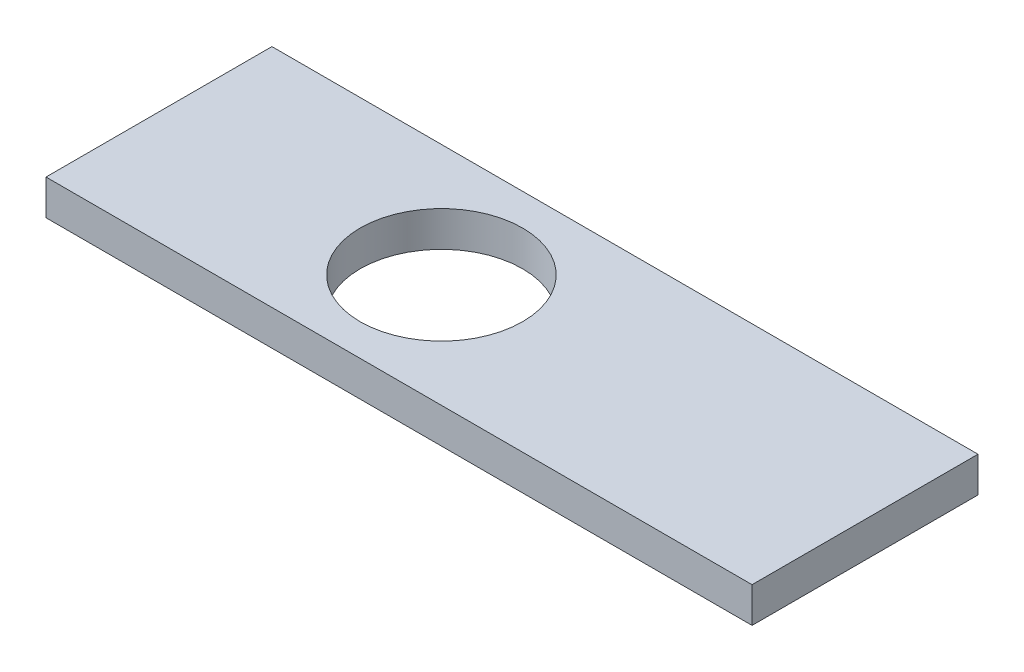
from build123d import *

# Parameters (mm, degrees)
SKETCH1_W           = 127
SKETCH1_H           = 40.64
BOSS_EXTRUDE1_DEPTH = 6.35
SKETCH2_R           = 14.605
CUT_EXTRUDE1_DEPTH  = 80.118044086


with BuildPart() as part:
    # Sketch1 → Boss-Extrude1 (new body)
    with BuildSketch(Plane(origin=(0, 0, 0), x_dir=(1, 0, 0), z_dir=(0, 1, 0))):
        with Locations((12.7, 0)):
            Rectangle(SKETCH1_W, SKETCH1_H)
    extrude(amount=-BOSS_EXTRUDE1_DEPTH)

    # Sketch2 → Cut-Extrude1 (cut, through all)
    with BuildSketch(Plane(origin=(0, 0, 0), x_dir=(1, 0, 0), z_dir=(0, 1, 0))):
        with Locations(Location((0, 0, 0), (0, 0, 270))):
            Circle(SKETCH2_R)
    extrude(amount=-CUT_EXTRUDE1_DEPTH, mode=Mode.SUBTRACT)


solid = part.part
